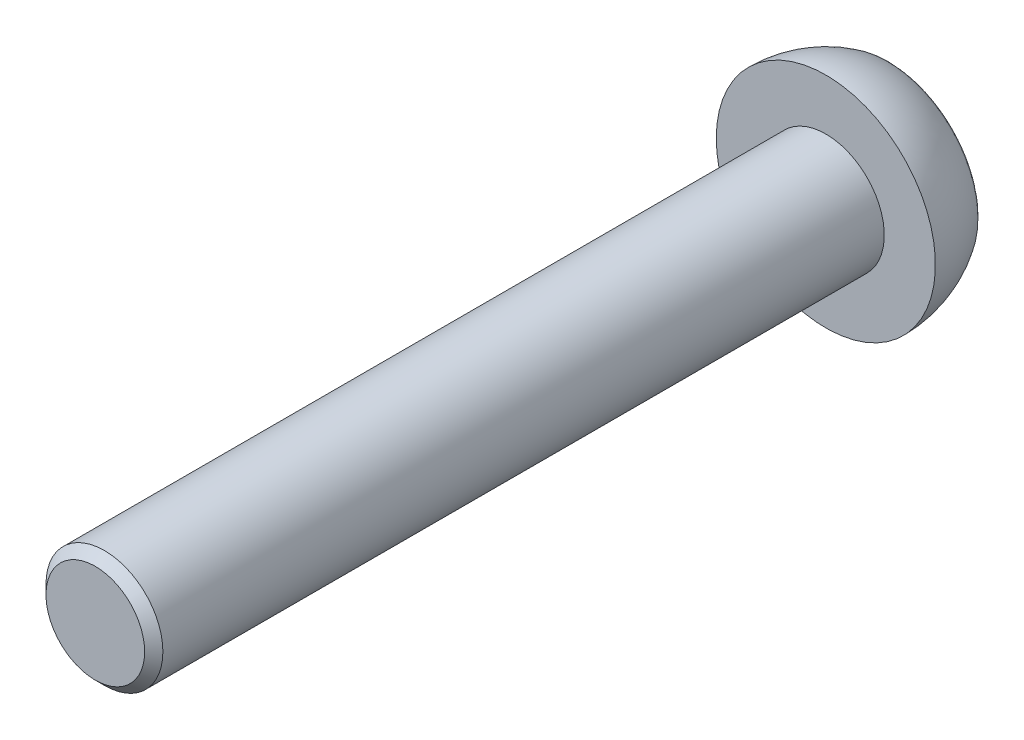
ISO-10303-21;
HEADER;
FILE_DESCRIPTION(('STEP AP214'),'2;1');
FILE_NAME('part.step','',(''),(''),'','','');
FILE_SCHEMA(('AUTOMOTIVE_DESIGN { 1 0 10303 214 1 1 1 1 }'));
ENDSEC;
DATA;
#1=APPLICATION_CONTEXT('core data for automotive mechanical design processes');
#2=APPLICATION_PROTOCOL_DEFINITION('international standard','automotive_design',2000,#1);
#3=PRODUCT_CONTEXT('',#1,'mechanical');
#4=PRODUCT('Part','Part','',(#3));
#5=PRODUCT_RELATED_PRODUCT_CATEGORY('part','',(#4));
#6=PRODUCT_DEFINITION_FORMATION('','',#4);
#7=PRODUCT_DEFINITION_CONTEXT('part definition',#1,'design');
#8=PRODUCT_DEFINITION('design','',#6,#7);
#9=PRODUCT_DEFINITION_SHAPE('','',#8);
#10=(LENGTH_UNIT() NAMED_UNIT(*) SI_UNIT(.MILLI.,.METRE.));
#11=(NAMED_UNIT(*) PLANE_ANGLE_UNIT() SI_UNIT($,.RADIAN.));
#12=(NAMED_UNIT(*) SI_UNIT($,.STERADIAN.) SOLID_ANGLE_UNIT());
#13=UNCERTAINTY_MEASURE_WITH_UNIT(LENGTH_MEASURE(1.E-05),#10,'distance_accuracy_value','');
#14=(GEOMETRIC_REPRESENTATION_CONTEXT(3) GLOBAL_UNCERTAINTY_ASSIGNED_CONTEXT((#13)) GLOBAL_UNIT_ASSIGNED_CONTEXT((#10,
#11,#12)) REPRESENTATION_CONTEXT('',''));
#15=CARTESIAN_POINT('',(0.,0.,0.));
#16=DIRECTION('',(0.,0.,1.));
#17=DIRECTION('',(1.,0.,0.));
#18=AXIS2_PLACEMENT_3D('',#15,#16,#17);
#19=CARTESIAN_POINT('',(65.729142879,215.039383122,-35.5));
#20=DIRECTION('',(0.,0.,-1.));
#21=DIRECTION('',(-0.99997700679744,-0.00678128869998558,0.));
#22=AXIS2_PLACEMENT_3D('',#19,#20,#21);
#23=PLANE('',#22);
#24=DIRECTION('',(-0.49411573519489,-0.869396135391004,0.));
#25=VECTOR('',#24,1.);
#26=CARTESIAN_POINT('',(64.4644897,217.1959202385,-35.5));
#27=LINE('',#26,#25);
#28=CARTESIAN_POINT('',(65.6997790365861,219.369410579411,-35.5));
#29=VERTEX_POINT('',#28);
#30=CARTESIAN_POINT('',(63.229200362,215.022429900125,-35.5));
#31=VERTEX_POINT('',#30);
#32=EDGE_CURVE('E137',#29,#31,#27,.T.);
#33=ORIENTED_EDGE('',*,*,#32,.T.);
#34=DIRECTION('',(-0.999977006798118,-0.00678128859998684,0.));
#35=VECTOR('',#34,1.);
#36=CARTESIAN_POINT('',(60.729257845,215.0054766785,-35.5));
#37=LINE('',#36,#35);
#38=CARTESIAN_POINT('',(58.229315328,214.988523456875,-35.5));
#39=VERTEX_POINT('',#38);
#40=EDGE_CURVE('E111',#31,#39,#37,.T.);
#41=ORIENTED_EDGE('',*,*,#40,.T.);
#42=DIRECTION('',(-0.505861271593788,0.862614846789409,0.));
#43=VECTOR('',#42,1.);
#44=CARTESIAN_POINT('',(56.964662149,217.145060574,-35.5));
#45=LINE('',#44,#43);
#46=CARTESIAN_POINT('',(55.7000089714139,219.301597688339,-35.5));
#47=VERTEX_POINT('',#46);
#48=EDGE_CURVE('E107',#39,#47,#45,.T.);
#49=ORIENTED_EDGE('',*,*,#48,.T.);
#50=DIRECTION('',(0.494115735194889,0.869396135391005,0.));
#51=VECTOR('',#50,1.);
#52=CARTESIAN_POINT('',(56.935298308,221.4750880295,-35.5));
#53=LINE('',#52,#51);
#54=CARTESIAN_POINT('',(58.170587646,223.648578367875,-35.5));
#55=VERTEX_POINT('',#54);
#56=EDGE_CURVE('E109',#47,#55,#53,.T.);
#57=ORIENTED_EDGE('',*,*,#56,.T.);
#58=DIRECTION('',(0.999977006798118,0.00678128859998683,0.));
#59=VECTOR('',#58,1.);
#60=CARTESIAN_POINT('',(60.670530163,223.6655315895,-35.5));
#61=LINE('',#60,#59);
#62=CARTESIAN_POINT('',(63.17047268,223.68248481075,-35.5));
#63=VERTEX_POINT('',#62);
#64=EDGE_CURVE('E93',#55,#63,#61,.T.);
#65=ORIENTED_EDGE('',*,*,#64,.T.);
#66=DIRECTION('',(0.505861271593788,-0.862614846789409,0.));
#67=VECTOR('',#66,1.);
#68=CARTESIAN_POINT('',(64.435125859,221.525947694,-35.5));
#69=LINE('',#68,#67);
#70=EDGE_CURVE('E146',#63,#29,#69,.T.);
#71=ORIENTED_EDGE('',*,*,#70,.T.);
#72=EDGE_LOOP('',(#33,#41,#49,#57,#65,#71));
#73=FACE_BOUND('',#72,.T.);
#74=ADVANCED_FACE('F37',(#73),#23,.T.);
#75=CARTESIAN_POINT('',(60.699894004,219.335504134,-20.25));
#76=DIRECTION('',(0.,0.,-1.));
#77=DIRECTION('',(-1.,0.,0.));
#78=AXIS2_PLACEMENT_3D('',#75,#76,#77);
#79=CYLINDRICAL_SURFACE('',#78,3.99999999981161);
#80=CARTESIAN_POINT('',(60.699894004,219.335504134,14.375));
#81=DIRECTION('',(0.,0.,1.));
#82=DIRECTION('',(1.,0.,0.));
#83=AXIS2_PLACEMENT_3D('',#80,#81,#82);
#84=CIRCLE('',#83,3.99999999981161);
#85=CARTESIAN_POINT('',(64.6998940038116,219.335504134,14.375));
#86=VERTEX_POINT('',#85);
#87=EDGE_CURVE('E11',#86,#86,#84,.F.);
#88=ORIENTED_EDGE('',*,*,#87,.T.);
#89=EDGE_LOOP('',(#88));
#90=FACE_BOUND('',#89,.T.);
#91=CARTESIAN_POINT('',(60.699894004,219.335504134,-35.));
#92=DIRECTION('',(0.,0.,-1.));
#93=DIRECTION('',(-1.,0.,0.));
#94=AXIS2_PLACEMENT_3D('',#91,#92,#93);
#95=CIRCLE('',#94,3.99999999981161);
#96=CARTESIAN_POINT('',(56.6998940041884,219.335504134,-35.));
#97=VERTEX_POINT('',#96);
#98=EDGE_CURVE('E164',#97,#97,#95,.F.);
#99=ORIENTED_EDGE('',*,*,#98,.T.);
#100=EDGE_LOOP('',(#99));
#101=FACE_BOUND('',#100,.T.);
#102=ADVANCED_FACE('F213',(#90,#101),#79,.T.);
#103=CARTESIAN_POINT('',(58.170587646,223.648578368,-39.4));
#104=DIRECTION('',(-0.869396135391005,0.494115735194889,0.));
#105=DIRECTION('',(-0.494115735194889,-0.869396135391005,0.));
#106=AXIS2_PLACEMENT_3D('',#103,#104,#105);
#107=PLANE('',#106);
#108=DIRECTION('',(0.,0.,1.));
#109=VECTOR('',#108,1.);
#110=CARTESIAN_POINT('',(58.170587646,223.648578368,-37.45));
#111=LINE('',#110,#109);
#112=CARTESIAN_POINT('',(58.170587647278,223.648578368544,-39.4));
#113=VERTEX_POINT('',#112);
#114=EDGE_CURVE('E120',#113,#55,#111,.T.);
#115=ORIENTED_EDGE('',*,*,#114,.T.);
#116=ORIENTED_EDGE('',*,*,#56,.F.);
#117=DIRECTION('',(0.,0.,-1.));
#118=VECTOR('',#117,1.);
#119=CARTESIAN_POINT('',(55.70000897,219.301597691,-37.45));
#120=LINE('',#119,#118);
#121=CARTESIAN_POINT('',(55.7000089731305,219.30159769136,-39.4));
#122=VERTEX_POINT('',#121);
#123=EDGE_CURVE('E116',#47,#122,#120,.T.);
#124=ORIENTED_EDGE('',*,*,#123,.T.);
#125=DIRECTION('',(-0.494115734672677,-0.8693961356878,0.));
#126=VECTOR('',#125,1.);
#127=CARTESIAN_POINT('',(58.1705876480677,223.648578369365,-39.4));
#128=LINE('',#127,#126);
#129=EDGE_CURVE('E84',#113,#122,#128,.T.);
#130=ORIENTED_EDGE('',*,*,#129,.F.);
#131=EDGE_LOOP('',(#115,#116,#124,#130));
#132=FACE_BOUND('',#131,.T.);
#133=ADVANCED_FACE('F118',(#132),#107,.F.);
#134=CARTESIAN_POINT('',(55.70000897,219.301597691,-39.4));
#135=DIRECTION('',(-0.862614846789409,-0.505861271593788,0.));
#136=DIRECTION('',(0.505861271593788,-0.862614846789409,0.));
#137=AXIS2_PLACEMENT_3D('',#134,#135,#136);
#138=PLANE('',#137);
#139=ORIENTED_EDGE('',*,*,#123,.F.);
#140=ORIENTED_EDGE('',*,*,#48,.F.);
#141=DIRECTION('',(0.,0.,-1.));
#142=VECTOR('',#141,1.);
#143=CARTESIAN_POINT('',(58.229315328,214.988523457,-37.45));
#144=LINE('',#143,#142);
#145=CARTESIAN_POINT('',(58.2293153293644,214.988523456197,-39.4));
#146=VERTEX_POINT('',#145);
#147=EDGE_CURVE('E130',#39,#146,#144,.T.);
#148=ORIENTED_EDGE('',*,*,#147,.T.);
#149=DIRECTION('',(0.505861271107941,-0.862614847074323,0.));
#150=VECTOR('',#149,1.);
#151=CARTESIAN_POINT('',(55.7000089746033,219.301597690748,-39.4));
#152=LINE('',#151,#150);
#153=EDGE_CURVE('E125',#122,#146,#152,.T.);
#154=ORIENTED_EDGE('',*,*,#153,.F.);
#155=EDGE_LOOP('',(#139,#140,#148,#154));
#156=FACE_BOUND('',#155,.T.);
#157=ADVANCED_FACE('F123',(#156),#138,.F.);
#158=CARTESIAN_POINT('',(58.229315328,214.988523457,-35.5));
#159=DIRECTION('',(0.00678128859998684,-0.999977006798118,0.));
#160=DIRECTION('',(0.,0.,-1.));
#161=AXIS2_PLACEMENT_3D('',#158,#159,#160);
#162=PLANE('',#161);
#163=ORIENTED_EDGE('',*,*,#147,.F.);
#164=ORIENTED_EDGE('',*,*,#40,.F.);
#165=DIRECTION('',(0.,0.,-1.));
#166=VECTOR('',#165,1.);
#167=CARTESIAN_POINT('',(63.229200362,215.0224299,-37.45));
#168=LINE('',#167,#166);
#169=CARTESIAN_POINT('',(63.2292003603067,215.022429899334,-39.4));
#170=VERTEX_POINT('',#169);
#171=EDGE_CURVE('E143',#31,#170,#168,.T.);
#172=ORIENTED_EDGE('',*,*,#171,.T.);
#173=DIRECTION('',(0.999977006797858,0.00678128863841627,0.));
#174=VECTOR('',#173,1.);
#175=CARTESIAN_POINT('',(60.7292578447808,215.005476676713,-39.4));
#176=LINE('',#175,#174);
#177=EDGE_CURVE('E138',#146,#170,#176,.T.);
#178=ORIENTED_EDGE('',*,*,#177,.F.);
#179=EDGE_LOOP('',(#163,#164,#172,#178));
#180=FACE_BOUND('',#179,.T.);
#181=ADVANCED_FACE('F244',(#180),#162,.F.);
#182=CARTESIAN_POINT('',(63.229200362,215.0224299,-39.4));
#183=DIRECTION('',(0.869396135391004,-0.49411573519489,0.));
#184=DIRECTION('',(0.49411573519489,0.869396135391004,0.));
#185=AXIS2_PLACEMENT_3D('',#182,#183,#184);
#186=PLANE('',#185);
#187=ORIENTED_EDGE('',*,*,#171,.F.);
#188=ORIENTED_EDGE('',*,*,#32,.F.);
#189=DIRECTION('',(0.,0.,-1.));
#190=VECTOR('',#189,1.);
#191=CARTESIAN_POINT('',(65.699779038,219.369410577,-37.45));
#192=LINE('',#191,#190);
#193=CARTESIAN_POINT('',(65.6997790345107,219.369410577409,-39.4));
#194=VERTEX_POINT('',#193);
#195=EDGE_CURVE('E236',#29,#194,#192,.T.);
#196=ORIENTED_EDGE('',*,*,#195,.T.);
#197=DIRECTION('',(0.494115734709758,0.869396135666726,0.));
#198=VECTOR('',#197,1.);
#199=CARTESIAN_POINT('',(63.2292003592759,215.022429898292,-39.4));
#200=LINE('',#199,#198);
#201=EDGE_CURVE('E142',#170,#194,#200,.T.);
#202=ORIENTED_EDGE('',*,*,#201,.F.);
#203=EDGE_LOOP('',(#187,#188,#196,#202));
#204=FACE_BOUND('',#203,.T.);
#205=ADVANCED_FACE('F247',(#204),#186,.F.);
#206=CARTESIAN_POINT('',(65.699779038,219.369410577,-39.4));
#207=DIRECTION('',(0.862614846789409,0.505861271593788,0.));
#208=DIRECTION('',(-0.505861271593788,0.862614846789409,0.));
#209=AXIS2_PLACEMENT_3D('',#206,#207,#208);
#210=PLANE('',#209);
#211=ORIENTED_EDGE('',*,*,#195,.F.);
#212=ORIENTED_EDGE('',*,*,#70,.F.);
#213=DIRECTION('',(0.,0.,-1.));
#214=VECTOR('',#213,1.);
#215=CARTESIAN_POINT('',(63.17047268,223.682484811,-37.45));
#216=LINE('',#215,#214);
#217=CARTESIAN_POINT('',(63.1704726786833,223.682484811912,-39.4));
#218=VERTEX_POINT('',#217);
#219=EDGE_CURVE('E233',#63,#218,#216,.T.);
#220=ORIENTED_EDGE('',*,*,#219,.T.);
#221=DIRECTION('',(-0.505861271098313,0.862614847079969,0.));
#222=VECTOR('',#221,1.);
#223=CARTESIAN_POINT('',(65.6997790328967,219.369410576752,-39.4));
#224=LINE('',#223,#222);
#225=EDGE_CURVE('E152',#194,#218,#224,.T.);
#226=ORIENTED_EDGE('',*,*,#225,.F.);
#227=EDGE_LOOP('',(#211,#212,#220,#226));
#228=FACE_BOUND('',#227,.T.);
#229=ADVANCED_FACE('F322',(#228),#210,.F.);
#230=CARTESIAN_POINT('',(58.170587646,223.648578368,-39.4));
#231=DIRECTION('',(-0.00678128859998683,0.999977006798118,0.));
#232=DIRECTION('',(0.,0.,1.));
#233=AXIS2_PLACEMENT_3D('',#230,#231,#232);
#234=PLANE('',#233);
#235=ORIENTED_EDGE('',*,*,#219,.F.);
#236=ORIENTED_EDGE('',*,*,#64,.F.);
#237=ORIENTED_EDGE('',*,*,#114,.F.);
#238=DIRECTION('',(-0.999977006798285,-0.00678128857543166,0.));
#239=VECTOR('',#238,1.);
#240=CARTESIAN_POINT('',(60.6705301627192,223.665531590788,-39.4));
#241=LINE('',#240,#239);
#242=EDGE_CURVE('E156',#218,#113,#241,.T.);
#243=ORIENTED_EDGE('',*,*,#242,.F.);
#244=EDGE_LOOP('',(#235,#236,#237,#243));
#245=FACE_BOUND('',#244,.T.);
#246=ADVANCED_FACE('F212',(#245),#234,.F.);
#247=CARTESIAN_POINT('',(60.739313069,213.52272114,-39.4));
#248=CARTESIAN_POINT('',(49.113747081,213.443883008,-39.4));
#249=CARTESIAN_POINT('',(49.03490895,225.069448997,-39.4));
#250=CARTESIAN_POINT('',(60.660474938,225.148287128,-39.4));
#251=CARTESIAN_POINT('',(60.740467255,213.35252351,-39.4));
#252=CARTESIAN_POINT('',(48.774506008,213.271377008,-39.4));
#253=CARTESIAN_POINT('',(48.693359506,225.237338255,-39.4));
#254=CARTESIAN_POINT('',(60.659320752,225.318484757,-39.4));
#255=CARTESIAN_POINT('',(60.741485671,213.202346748,-39.319909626));
#256=CARTESIAN_POINT('',(48.475170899,213.119163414,-39.319909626));
#257=CARTESIAN_POINT('',(48.391987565,225.385478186,-39.319909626));
#258=CARTESIAN_POINT('',(60.658302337,225.46866152,-39.319909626));
#259=CARTESIAN_POINT('',(60.742128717,213.107522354,-39.178571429));
#260=CARTESIAN_POINT('',(48.286165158,213.023052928,-39.178571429));
#261=CARTESIAN_POINT('',(48.201695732,225.479016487,-39.178571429));
#262=CARTESIAN_POINT('',(60.657659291,225.563485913,-39.178571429));
#263=(BOUNDED_SURFACE() B_SPLINE_SURFACE(3,3,((#247,#248,#249,#250),(#251,#252,#253,#254),(#255,
#256,#257,#258),(#259,#260,#261,#262)),.UNSPECIFIED.,.F.,.F.,
.F.) B_SPLINE_SURFACE_WITH_KNOTS((4,4),(4,4),(0.,1.),(0.,1.),
.UNSPECIFIED.) GEOMETRIC_REPRESENTATION_ITEM() RATIONAL_B_SPLINE_SURFACE(((1.,0.333333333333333,
0.333333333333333,1.),(0.921577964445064,0.307192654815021,0.307192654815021,0.921577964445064),
(0.921577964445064,0.307192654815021,0.307192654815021,0.921577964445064),(1.,0.333333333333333,
0.333333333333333,1.))) REPRESENTATION_ITEM('') SURFACE());
#264=CARTESIAN_POINT('',(60.660474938,225.148287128,-39.4));
#265=CARTESIAN_POINT('',(60.659320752,225.318484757,-39.4));
#266=CARTESIAN_POINT('',(60.658302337,225.46866152,-39.319909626));
#267=CARTESIAN_POINT('',(60.657659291,225.563485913,-39.178571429));
#268=(BOUNDED_CURVE() B_SPLINE_CURVE(3,(#264,#265,#266,#267),.UNSPECIFIED.,.F.,
.F.) B_SPLINE_CURVE_WITH_KNOTS((4,4),(0.,1.),
.UNSPECIFIED.) CURVE() GEOMETRIC_REPRESENTATION_ITEM() RATIONAL_B_SPLINE_CURVE((1.,
0.921577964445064,0.921577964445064,1.)) REPRESENTATION_ITEM(''));
#269=CARTESIAN_POINT('',(60.6576592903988,225.563485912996,-39.178571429));
#270=VERTEX_POINT('',#269);
#271=CARTESIAN_POINT('',(60.6604749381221,225.148287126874,-39.4));
#272=VERTEX_POINT('',#271);
#273=EDGE_CURVE('E167',#270,#272,#268,.F.);
#274=CARTESIAN_POINT('',(60.660474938,225.148287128,-39.4));
#275=CARTESIAN_POINT('',(49.03490895,225.069448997,-39.4));
#276=CARTESIAN_POINT('',(49.113747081,213.443883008,-39.4));
#277=CARTESIAN_POINT('',(60.739313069,213.52272114,-39.4));
#278=(BOUNDED_CURVE() B_SPLINE_CURVE(3,(#274,#275,#276,#277),.UNSPECIFIED.,.F.,
.F.) B_SPLINE_CURVE_WITH_KNOTS((4,4),(0.,1.),
.UNSPECIFIED.) CURVE() GEOMETRIC_REPRESENTATION_ITEM() RATIONAL_B_SPLINE_CURVE((1.,
0.333333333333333,0.333333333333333,1.)) REPRESENTATION_ITEM(''));
#279=CARTESIAN_POINT('',(60.7393130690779,213.522721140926,-39.4));
#280=VERTEX_POINT('',#279);
#281=EDGE_CURVE('E163',#280,#272,#278,.F.);
#282=CARTESIAN_POINT('',(60.739313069,213.52272114,-39.4));
#283=CARTESIAN_POINT('',(60.740467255,213.35252351,-39.4));
#284=CARTESIAN_POINT('',(60.741485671,213.202346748,-39.319909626));
#285=CARTESIAN_POINT('',(60.742128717,213.107522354,-39.178571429));
#286=(BOUNDED_CURVE() B_SPLINE_CURVE(3,(#282,#283,#284,#285),.UNSPECIFIED.,.F.,
.F.) B_SPLINE_CURVE_WITH_KNOTS((4,4),(0.,1.),
.UNSPECIFIED.) CURVE() GEOMETRIC_REPRESENTATION_ITEM() RATIONAL_B_SPLINE_CURVE((1.,
0.921577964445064,0.921577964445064,1.)) REPRESENTATION_ITEM(''));
#287=CARTESIAN_POINT('',(60.7421287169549,213.107522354,-39.178571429));
#288=VERTEX_POINT('',#287);
#289=EDGE_CURVE('E261',#280,#288,#286,.T.);
#290=CARTESIAN_POINT('',(60.699894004,219.335504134,-39.1785713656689));
#291=DIRECTION('',(0.,0.,-1.));
#292=DIRECTION('',(0.999977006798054,0.00678128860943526,0.));
#293=AXIS2_PLACEMENT_3D('',#290,#291,#292);
#294=CIRCLE('',#293,6.22812502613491);
#295=EDGE_CURVE('E151',#288,#270,#294,.T.);
#296=ORIENTED_EDGE('',*,*,#273,.T.);
#297=ORIENTED_EDGE('',*,*,#281,.F.);
#298=ORIENTED_EDGE('',*,*,#289,.T.);
#299=ORIENTED_EDGE('',*,*,#295,.T.);
#300=EDGE_LOOP('',(#296,#297,#298,#299));
#301=FACE_BOUND('',#300,.T.);
#302=ADVANCED_FACE('F199',(#301),#263,.T.);
#303=CARTESIAN_POINT('',(68.341189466,211.797148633,-35.));
#304=DIRECTION('',(0.,0.,-1.));
#305=DIRECTION('',(-0.999977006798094,-0.00678128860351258,0.));
#306=AXIS2_PLACEMENT_3D('',#303,#304,#305);
#307=PLANE('',#306);
#308=ORIENTED_EDGE('',*,*,#98,.F.);
#309=EDGE_LOOP('',(#308));
#310=FACE_BOUND('',#309,.T.);
#311=CARTESIAN_POINT('',(60.699894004,219.335504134,-35.));
#312=DIRECTION('',(0.,0.,-1.));
#313=DIRECTION('',(-1.,0.,0.));
#314=AXIS2_PLACEMENT_3D('',#311,#312,#313);
#315=CIRCLE('',#314,7.50000000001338);
#316=CARTESIAN_POINT('',(53.1998940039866,219.335504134,-35.));
#317=VERTEX_POINT('',#316);
#318=EDGE_CURVE('E147',#317,#317,#315,.F.);
#319=ORIENTED_EDGE('',*,*,#318,.T.);
#320=EDGE_LOOP('',(#319));
#321=FACE_BOUND('',#320,.T.);
#322=ADVANCED_FACE('F211',(#310,#321),#307,.F.);
#323=CARTESIAN_POINT('',(54.857249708,213.413075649,-39.4));
#324=DIRECTION('',(0.,0.,-1.));
#325=DIRECTION('',(-0.00678128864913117,0.999977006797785,0.));
#326=AXIS2_PLACEMENT_3D('',#323,#324,#325);
#327=PLANE('',#326);
#328=ORIENTED_EDGE('',*,*,#225,.T.);
#329=ORIENTED_EDGE('',*,*,#242,.T.);
#330=ORIENTED_EDGE('',*,*,#129,.T.);
#331=ORIENTED_EDGE('',*,*,#153,.T.);
#332=ORIENTED_EDGE('',*,*,#177,.T.);
#333=ORIENTED_EDGE('',*,*,#201,.T.);
#334=EDGE_LOOP('',(#328,#329,#330,#331,#332,#333));
#335=FACE_BOUND('',#334,.T.);
#336=CARTESIAN_POINT('',(60.739313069,213.52272114,-39.4));
#337=CARTESIAN_POINT('',(60.8008187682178,213.523137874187,-39.4));
#338=CARTESIAN_POINT('',(60.8623179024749,213.524531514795,-39.4));
#339=CARTESIAN_POINT('',(60.9871907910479,213.529344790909,-39.4));
#340=CARTESIAN_POINT('',(61.0505621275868,213.532827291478,-39.4));
#341=CARTESIAN_POINT('',(61.1791615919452,213.542008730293,-39.4));
#342=CARTESIAN_POINT('',(61.2443849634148,213.54777437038,-39.4));
#343=CARTESIAN_POINT('',(61.3766560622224,213.561722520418,-39.4));
#344=CARTESIAN_POINT('',(61.443696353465,213.569975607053,-39.4));
#345=CARTESIAN_POINT('',(61.5795521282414,213.589109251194,-39.4));
#346=CARTESIAN_POINT('',(61.6483571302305,213.600064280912,-39.4));
#347=CARTESIAN_POINT('',(61.787674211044,213.624821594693,-39.4));
#348=CARTESIAN_POINT('',(61.8581723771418,213.638702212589,-39.4));
#349=CARTESIAN_POINT('',(62.0007863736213,213.669538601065,-39.4));
#350=CARTESIAN_POINT('',(62.0728844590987,213.686576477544,-39.4));
#351=CARTESIAN_POINT('',(62.2185851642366,213.723961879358,-39.4));
#352=CARTESIAN_POINT('',(62.2921657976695,213.744395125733,-39.4));
#353=CARTESIAN_POINT('',(62.4406922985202,213.78881043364,-39.4));
#354=CARTESIAN_POINT('',(62.5156115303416,213.812881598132,-39.4));
#355=CARTESIAN_POINT('',(62.6666473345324,213.864814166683,-39.4));
#356=CARTESIAN_POINT('',(62.7427322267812,213.892767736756,-39.4));
#357=CARTESIAN_POINT('',(62.8959005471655,213.952705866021,-39.4));
#358=CARTESIAN_POINT('',(62.9729468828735,213.984785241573,-39.4));
#359=CARTESIAN_POINT('',(63.1278062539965,214.053211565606,-39.4));
#360=CARTESIAN_POINT('',(63.2055764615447,214.089655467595,-39.4));
#361=CARTESIAN_POINT('',(63.3616168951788,214.16703919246,-39.4));
#362=CARTESIAN_POINT('',(63.4398382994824,214.208077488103,-39.4));
#363=CARTESIAN_POINT('',(63.596478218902,214.294865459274,-39.4));
#364=CARTESIAN_POINT('',(63.6748417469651,214.340714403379,-39.4));
#365=CARTESIAN_POINT('',(63.8314259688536,214.437321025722,-39.4));
#366=CARTESIAN_POINT('',(63.9095854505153,214.48817794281,-39.4));
#367=CARTESIAN_POINT('',(64.0653845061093,214.594974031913,-39.4));
#368=CARTESIAN_POINT('',(64.1429567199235,214.651011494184,-39.4));
#369=CARTESIAN_POINT('',(64.2971678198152,214.768312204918,-39.4));
#370=CARTESIAN_POINT('',(64.3737334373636,214.829671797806,-39.4));
#371=CARTESIAN_POINT('',(64.5254833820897,214.95772385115,-39.4));
#372=CARTESIAN_POINT('',(64.6005889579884,215.024509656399,-39.4));
#373=CARTESIAN_POINT('',(64.7489392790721,215.163478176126,-39.4));
#374=CARTESIAN_POINT('',(64.8221004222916,215.235750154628,-39.4));
#375=CARTESIAN_POINT('',(64.9660549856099,215.385705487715,-39.4));
#376=CARTESIAN_POINT('',(65.0367608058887,215.463472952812,-39.4));
#377=CARTESIAN_POINT('',(65.1752760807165,215.624378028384,-39.4));
#378=CARTESIAN_POINT('',(65.2429950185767,215.707593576,-39.4));
#379=CARTESIAN_POINT('',(65.374992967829,215.879292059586,-39.4));
#380=CARTESIAN_POINT('',(65.4391798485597,215.967845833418,-39.4));
#381=CARTESIAN_POINT('',(65.5635638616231,216.150052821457,-39.4));
#382=CARTESIAN_POINT('',(65.6236687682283,216.243769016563,-39.4));
#383=CARTESIAN_POINT('',(65.7393406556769,216.436060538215,-39.4));
#384=CARTESIAN_POINT('',(65.7948169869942,216.534690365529,-39.4));
#385=CARTESIAN_POINT('',(65.9007015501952,216.736509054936,-39.4));
#386=CARTESIAN_POINT('',(65.9510226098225,216.839743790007,-39.4));
#387=CARTESIAN_POINT('',(66.0220853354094,216.997205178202,-39.4));
#388=CARTESIAN_POINT('',(66.0451403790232,217.050399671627,-39.4));
#389=CARTESIAN_POINT('',(66.0897858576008,217.157783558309,-39.4));
#390=CARTESIAN_POINT('',(66.1113664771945,217.21197704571,-39.4));
#391=CARTESIAN_POINT('',(66.1530044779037,217.321297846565,-39.4));
#392=CARTESIAN_POINT('',(66.1730525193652,217.376428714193,-39.4));
#393=CARTESIAN_POINT('',(66.2115712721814,217.487561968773,-39.4));
#394=CARTESIAN_POINT('',(66.2300331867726,217.54356740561,-39.4));
#395=CARTESIAN_POINT('',(66.2653285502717,217.656382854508,-39.4));
#396=CARTESIAN_POINT('',(66.2821537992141,217.713195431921,-39.4));
#397=CARTESIAN_POINT('',(66.3141285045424,217.827554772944,-39.4));
#398=CARTESIAN_POINT('',(66.3292704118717,217.885103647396,-39.4));
#399=CARTESIAN_POINT('',(66.357835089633,218.000861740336,-39.4));
#400=CARTESIAN_POINT('',(66.3712510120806,218.059072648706,-39.4));
#401=CARTESIAN_POINT('',(66.3963246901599,218.176077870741,-39.4));
#402=CARTESIAN_POINT('',(66.4079763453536,218.234873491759,-39.4));
#403=CARTESIAN_POINT('',(66.4294870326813,218.352968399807,-39.4));
#404=CARTESIAN_POINT('',(66.4393407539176,218.412268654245,-39.4));
#405=CARTESIAN_POINT('',(66.4572259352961,218.531290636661,-39.4));
#406=CARTESIAN_POINT('',(66.4652529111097,218.591013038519,-39.4));
#407=CARTESIAN_POINT('',(66.4794599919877,218.710795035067,-39.4));
#408=CARTESIAN_POINT('',(66.4856364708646,218.770855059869,-39.4));
#409=CARTESIAN_POINT('',(66.4961231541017,218.891226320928,-39.4));
#410=CARTESIAN_POINT('',(66.5004306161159,218.951537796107,-39.4));
#411=CARTESIAN_POINT('',(66.5071652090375,219.072324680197,-39.4));
#412=CARTESIAN_POINT('',(66.5095905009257,219.132800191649,-39.4));
#413=CARTESIAN_POINT('',(66.5125521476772,219.253826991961,-39.4));
#414=CARTESIAN_POINT('',(66.5130875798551,219.314378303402,-39.4));
#415=CARTESIAN_POINT('',(66.5122664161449,219.435468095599,-39.4));
#416=CARTESIAN_POINT('',(66.5109098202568,219.496006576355,-39.4));
#417=CARTESIAN_POINT('',(66.5063070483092,219.616982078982,-39.4));
#418=CARTESIAN_POINT('',(66.5030617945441,219.677419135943,-39.4));
#419=CARTESIAN_POINT('',(66.4946896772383,219.798103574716,-39.4));
#420=CARTESIAN_POINT('',(66.4895646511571,219.858351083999,-39.4));
#421=CARTESIAN_POINT('',(66.4774464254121,219.978569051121,-39.4));
#422=CARTESIAN_POINT('',(66.4704559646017,220.038539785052,-39.4));
#423=CARTESIAN_POINT('',(66.4546256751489,220.158118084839,-39.4));
#424=CARTESIAN_POINT('',(66.4457894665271,220.217726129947,-39.4));
#425=CARTESIAN_POINT('',(66.4262917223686,220.336494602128,-39.4));
#426=CARTESIAN_POINT('',(66.4156346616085,220.395655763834,-39.4));
#427=CARTESIAN_POINT('',(66.3925243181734,220.513448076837,-39.4));
#428=CARTESIAN_POINT('',(66.3800763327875,220.572080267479,-39.4));
#429=CARTESIAN_POINT('',(66.3534181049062,220.688734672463,-39.4));
#430=CARTESIAN_POINT('',(66.3392139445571,220.746758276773,-39.4));
#431=CARTESIAN_POINT('',(66.3090819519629,220.862118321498,-39.4));
#432=CARTESIAN_POINT('',(66.2931609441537,220.919456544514,-39.4));
#433=CARTESIAN_POINT('',(66.2596382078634,221.033371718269,-39.4));
#434=CARTESIAN_POINT('',(66.2420439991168,221.089950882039,-39.4));
#435=CARTESIAN_POINT('',(66.2052218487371,221.202277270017,-39.4));
#436=CARTESIAN_POINT('',(66.1860020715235,221.25802717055,-39.4));
#437=CARTESIAN_POINT('',(66.1459796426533,221.368627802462,-39.4));
#438=CARTESIAN_POINT('',(66.1251857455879,221.423481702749,-39.4));
#439=CARTESIAN_POINT('',(66.0820689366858,221.532227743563,-39.4));
#440=CARTESIAN_POINT('',(66.0597553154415,221.586123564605,-39.4));
#441=CARTESIAN_POINT('',(66.013657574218,221.692892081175,-39.4));
#442=CARTESIAN_POINT('',(65.9898832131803,221.745769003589,-39.4));
#443=CARTESIAN_POINT('',(65.9166914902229,221.902252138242,-39.4));
#444=CARTESIAN_POINT('',(65.8649749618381,222.004794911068,-39.4));
#445=CARTESIAN_POINT('',(65.7563630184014,222.205159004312,-39.4));
#446=CARTESIAN_POINT('',(65.699554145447,222.30302737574,-39.4));
#447=CARTESIAN_POINT('',(65.5812849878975,222.49373243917,-39.4));
#448=CARTESIAN_POINT('',(65.5199146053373,222.58662485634,-39.4));
#449=CARTESIAN_POINT('',(65.3930708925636,222.767128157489,-39.4));
#450=CARTESIAN_POINT('',(65.3276889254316,222.854803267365,-39.4));
#451=CARTESIAN_POINT('',(65.1933744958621,223.024695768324,-39.4));
#452=CARTESIAN_POINT('',(65.1245331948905,223.106985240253,-39.4));
#453=CARTESIAN_POINT('',(64.9838484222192,223.265996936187,-39.4));
#454=CARTESIAN_POINT('',(64.9120944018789,223.342798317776,-39.4));
#455=CARTESIAN_POINT('',(64.7661193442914,223.490787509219,-39.4));
#456=CARTESIAN_POINT('',(64.6919847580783,223.562060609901,-39.4));
#457=CARTESIAN_POINT('',(64.5417633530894,223.699004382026,-39.4));
#458=CARTESIAN_POINT('',(64.4657589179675,223.764765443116,-39.4));
#459=CARTESIAN_POINT('',(64.3122862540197,223.890747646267,-39.4));
#460=CARTESIAN_POINT('',(64.2348955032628,223.951063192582,-39.4));
#461=CARTESIAN_POINT('',(64.0791077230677,224.066261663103,-39.4));
#462=CARTESIAN_POINT('',(64.0007826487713,224.12124191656,-39.4));
#463=CARTESIAN_POINT('',(63.8435495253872,224.225915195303,-39.4));
#464=CARTESIAN_POINT('',(63.7647074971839,224.275707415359,-39.4));
#465=CARTESIAN_POINT('',(63.6068274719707,224.370181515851,-39.4));
#466=CARTESIAN_POINT('',(63.5278493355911,224.414963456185,-39.4));
#467=CARTESIAN_POINT('',(63.3700467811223,224.499619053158,-39.4));
#468=CARTESIAN_POINT('',(63.291275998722,224.539592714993,-39.4));
#469=CARTESIAN_POINT('',(63.1342004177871,224.614853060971,-39.4));
#470=CARTESIAN_POINT('',(63.0559431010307,224.650238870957,-39.4));
#471=CARTESIAN_POINT('',(62.9001699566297,224.716558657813,-39.4));
#472=CARTESIAN_POINT('',(62.8226956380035,224.747590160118,-39.4));
#473=CARTESIAN_POINT('',(62.6687285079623,224.805445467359,-39.4));
#474=CARTESIAN_POINT('',(62.5922714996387,224.832364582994,-39.4));
#475=CARTESIAN_POINT('',(62.4405452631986,224.882243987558,-39.4));
#476=CARTESIAN_POINT('',(62.3653064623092,224.905296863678,-39.4));
#477=CARTESIAN_POINT('',(62.216191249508,224.947693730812,-39.4));
#478=CARTESIAN_POINT('',(62.1423402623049,224.967127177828,-39.4));
#479=CARTESIAN_POINT('',(61.9961459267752,225.002533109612,-39.4));
#480=CARTESIAN_POINT('',(61.9238234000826,225.01859160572,-39.4));
#481=CARTESIAN_POINT('',(61.7808043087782,225.047490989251,-39.4));
#482=CARTESIAN_POINT('',(61.7101243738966,225.060414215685,-39.4));
#483=CARTESIAN_POINT('',(61.5704843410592,225.083279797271,-39.4));
#484=CARTESIAN_POINT('',(61.5015370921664,225.09330066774,-39.4));
#485=CARTESIAN_POINT('',(61.3654343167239,225.110590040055,-39.4));
#486=CARTESIAN_POINT('',(61.298288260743,225.117933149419,-39.4));
#487=CARTESIAN_POINT('',(61.1658401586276,225.130086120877,-39.4));
#488=CARTESIAN_POINT('',(61.1005445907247,225.134966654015,-39.4));
#489=CARTESIAN_POINT('',(60.9718324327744,225.142403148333,-39.4));
#490=CARTESIAN_POINT('',(60.9084196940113,225.145025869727,-39.4));
#491=CARTESIAN_POINT('',(60.7834930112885,225.148145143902,-39.4));
#492=CARTESIAN_POINT('',(60.7219806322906,225.148704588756,-39.4));
#493=CARTESIAN_POINT('',(60.660474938,225.148287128,-39.4));
#494=B_SPLINE_CURVE_WITH_KNOTS('',3,(#336,#337,#338,#339,#340,#341,#342,#343,#344,#345,#346,
#347,#348,#349,#350,#351,#352,#353,#354,#355,#356,#357,#358,#359,#360,#361,#362,#363,#364,#365,
#366,#367,#368,#369,#370,#371,#372,#373,#374,#375,#376,#377,#378,#379,#380,#381,#382,#383,#384,
#385,#386,#387,#388,#389,#390,#391,#392,#393,#394,#395,#396,#397,#398,#399,#400,#401,#402,#403,
#404,#405,#406,#407,#408,#409,#410,#411,#412,#413,#414,#415,#416,#417,#418,#419,#420,#421,#422,
#423,#424,#425,#426,#427,#428,#429,#430,#431,#432,#433,#434,#435,#436,#437,#438,#439,#440,#441,
#442,#443,#444,#445,#446,#447,#448,#449,#450,#451,#452,#453,#454,#455,#456,#457,#458,#459,#460,
#461,#462,#463,#464,#465,#466,#467,#468,#469,#470,#471,#472,#473,#474,#475,#476,#477,#478,#479,
#480,#481,#482,#483,#484,#485,#486,#487,#488,#489,#490,#491,#492,#493),.UNSPECIFIED.,.F.,.F.,(4,
2,2,2,2,2,2,2,2,2,2,2,2,2,2,2,2,2,2,2,2,2,2,2,2,2,2,2,2,2,2,2,2,2,2,2,2,2,2,2,2,2,2,2,2,2,2,2,2,
2,2,2,2,2,2,2,2,2,2,2,2,2,2,2,2,2,2,2,2,2,2,2,2,2,2,2,2,2,4),(0.,0.184513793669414,
0.374880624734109,0.57127638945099,0.773874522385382,0.982844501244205,1.19835014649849,
1.42054770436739,1.64958370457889,1.8855925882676,2.12869410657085,2.37899049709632,
2.63656345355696,2.90147091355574,3.17374370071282,3.45338206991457,3.74035221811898,
4.03458283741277,4.33596180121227,4.6443330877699,4.95949405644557,5.28119320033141,
5.60912850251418,5.94294652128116,6.28224232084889,6.62656034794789,6.80046639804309,
6.97543560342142,7.15139778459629,7.32828014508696,7.50600742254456,7.68450205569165,
7.86368436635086,8.04347275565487,8.22378391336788,8.40453303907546,8.5856340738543,
8.76699994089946,8.94854279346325,9.13017426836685,9.31180574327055,9.49334859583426,
9.67471446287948,9.85581549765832,10.0365646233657,10.216875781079,10.396664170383,
10.575846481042,10.7543411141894,10.932068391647,11.1089507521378,11.2849129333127,
11.4598821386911,11.6337881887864,11.9781062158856,12.3174020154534,12.6512200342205,
12.9791553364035,13.3008544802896,13.6160154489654,13.9243867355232,14.2257656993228,
14.5199963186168,14.8069664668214,15.0866048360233,15.3588776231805,15.6237850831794,
15.8813580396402,16.1316544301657,16.3747559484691,16.6107648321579,16.8398008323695,
17.0619983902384,17.2775040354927,17.4864740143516,17.689072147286,17.8854679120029,
18.0758347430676,18.260348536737),.UNSPECIFIED.);
#495=EDGE_CURVE('E170',#280,#272,#494,.T.);
#496=ORIENTED_EDGE('',*,*,#495,.F.);
#497=ORIENTED_EDGE('',*,*,#281,.T.);
#498=EDGE_LOOP('',(#496,#497));
#499=FACE_BOUND('',#498,.T.);
#500=ADVANCED_FACE('F39',(#335,#499),#327,.T.);
#501=CARTESIAN_POINT('',(60.6998940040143,219.335504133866,-34.999999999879));
#502=DIRECTION('',(0.,0.,-1.));
#503=DIRECTION('',(-0.999977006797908,-0.0067812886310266,0.));
#504=AXIS2_PLACEMENT_3D('',#501,#502,#503);
#505=SPHERICAL_SURFACE('',#504,7.5);
#506=ORIENTED_EDGE('',*,*,#318,.F.);
#507=EDGE_LOOP('',(#506));
#508=FACE_BOUND('',#507,.T.);
#509=CARTESIAN_POINT('',(60.699894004,219.3355041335,-39.178571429));
#510=DIRECTION('',(0.,0.,-1.));
#511=DIRECTION('',(-1.,0.,0.));
#512=AXIS2_PLACEMENT_3D('',#509,#510,#511);
#513=CIRCLE('',#512,6.22812498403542);
#514=EDGE_CURVE('E55',#270,#288,#513,.T.);
#515=ORIENTED_EDGE('',*,*,#514,.F.);
#516=ORIENTED_EDGE('',*,*,#295,.F.);
#517=EDGE_LOOP('',(#515,#516));
#518=FACE_BOUND('',#517,.T.);
#519=ADVANCED_FACE('F215',(#508,#518),#505,.T.);
#520=CARTESIAN_POINT('',(60.660474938,225.148287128,-39.4));
#521=CARTESIAN_POINT('',(72.286040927,225.227125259,-39.4));
#522=CARTESIAN_POINT('',(72.364879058,213.601559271,-39.4));
#523=CARTESIAN_POINT('',(60.739313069,213.52272114,-39.4));
#524=CARTESIAN_POINT('',(60.659320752,225.318484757,-39.4));
#525=CARTESIAN_POINT('',(72.625281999,225.39963126,-39.4));
#526=CARTESIAN_POINT('',(72.706428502,213.433670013,-39.4));
#527=CARTESIAN_POINT('',(60.740467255,213.35252351,-39.4));
#528=CARTESIAN_POINT('',(60.658302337,225.46866152,-39.319909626));
#529=CARTESIAN_POINT('',(72.924617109,225.551844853,-39.319909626));
#530=CARTESIAN_POINT('',(73.007800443,213.285530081,-39.319909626));
#531=CARTESIAN_POINT('',(60.741485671,213.202346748,-39.319909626));
#532=CARTESIAN_POINT('',(60.657659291,225.563485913,-39.178571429));
#533=CARTESIAN_POINT('',(73.11362285,225.64795534,-39.178571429));
#534=CARTESIAN_POINT('',(73.198092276,213.191991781,-39.178571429));
#535=CARTESIAN_POINT('',(60.742128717,213.107522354,-39.178571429));
#536=(BOUNDED_SURFACE() B_SPLINE_SURFACE(3,3,((#520,#521,#522,#523),(#524,#525,#526,#527),(#528,
#529,#530,#531),(#532,#533,#534,#535)),.UNSPECIFIED.,.F.,.F.,
.F.) B_SPLINE_SURFACE_WITH_KNOTS((4,4),(4,4),(0.,1.),(0.,1.),
.UNSPECIFIED.) GEOMETRIC_REPRESENTATION_ITEM() RATIONAL_B_SPLINE_SURFACE(((1.,0.333333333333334,
0.333333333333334,1.),(0.921577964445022,0.307192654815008,0.307192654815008,0.921577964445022),
(0.921577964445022,0.307192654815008,0.307192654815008,0.921577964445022),(1.,0.333333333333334,
0.333333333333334,1.))) REPRESENTATION_ITEM('') SURFACE());
#537=ORIENTED_EDGE('',*,*,#273,.F.);
#538=ORIENTED_EDGE('',*,*,#514,.T.);
#539=ORIENTED_EDGE('',*,*,#289,.F.);
#540=ORIENTED_EDGE('',*,*,#495,.T.);
#541=EDGE_LOOP('',(#537,#538,#539,#540));
#542=FACE_BOUND('',#541,.T.);
#543=ADVANCED_FACE('F223',(#542),#536,.T.);
#544=CARTESIAN_POINT('',(60.699894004,219.335504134,15.));
#545=DIRECTION('',(0.,0.,1.));
#546=DIRECTION('',(1.,0.,0.));
#547=AXIS2_PLACEMENT_3D('',#544,#545,#546);
#548=PLANE('',#547);
#549=CARTESIAN_POINT('',(60.699894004,219.335504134,15.));
#550=DIRECTION('',(0.,0.,1.));
#551=DIRECTION('',(1.,0.,0.));
#552=AXIS2_PLACEMENT_3D('',#549,#550,#551);
#553=CIRCLE('',#552,3.3749999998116);
#554=CARTESIAN_POINT('',(64.0748940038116,219.335504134,15.));
#555=VERTEX_POINT('',#554);
#556=EDGE_CURVE('E48',#555,#555,#553,.T.);
#557=ORIENTED_EDGE('',*,*,#556,.T.);
#558=EDGE_LOOP('',(#557));
#559=FACE_BOUND('',#558,.T.);
#560=ADVANCED_FACE('F298',(#559),#548,.T.);
#561=CARTESIAN_POINT('',(60.699894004,219.335504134,15.));
#562=DIRECTION('',(0.,0.,-1.));
#563=DIRECTION('',(-1.,0.,0.));
#564=AXIS2_PLACEMENT_3D('',#561,#562,#563);
#565=CONICAL_SURFACE('',#564,3.3749999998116,0.785398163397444);
#566=ORIENTED_EDGE('',*,*,#87,.F.);
#567=EDGE_LOOP('',(#566));
#568=FACE_BOUND('',#567,.T.);
#569=ORIENTED_EDGE('',*,*,#556,.F.);
#570=EDGE_LOOP('',(#569));
#571=FACE_BOUND('',#570,.T.);
#572=ADVANCED_FACE('F302',(#568,#571),#565,.T.);
#573=CLOSED_SHELL('',(#74,#102,#133,#157,#181,#205,#229,#246,#302,#322,#500,#519,#543,#560,#572));
#574=MANIFOLD_SOLID_BREP('B2',#573);
#575=ADVANCED_BREP_SHAPE_REPRESENTATION('',(#18,#574),#14);
#576=SHAPE_DEFINITION_REPRESENTATION(#9,#575);
ENDSEC;
END-ISO-10303-21;
